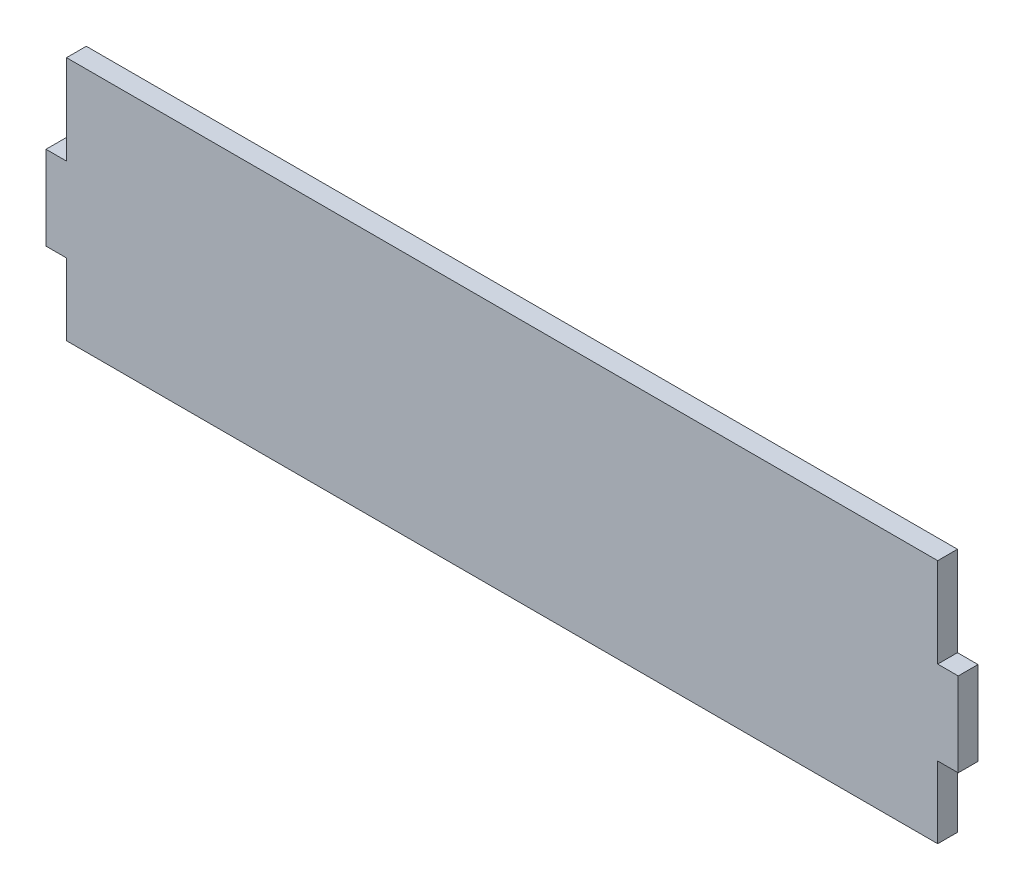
ISO-10303-21;
HEADER;
FILE_DESCRIPTION(('STEP AP214'),'2;1');
FILE_NAME('part.step','',(''),(''),'','','');
FILE_SCHEMA(('AUTOMOTIVE_DESIGN { 1 0 10303 214 1 1 1 1 }'));
ENDSEC;
DATA;
#1=APPLICATION_CONTEXT('core data for automotive mechanical design processes');
#2=APPLICATION_PROTOCOL_DEFINITION('international standard','automotive_design',2000,#1);
#3=PRODUCT_CONTEXT('',#1,'mechanical');
#4=PRODUCT('Part','Part','',(#3));
#5=PRODUCT_RELATED_PRODUCT_CATEGORY('part','',(#4));
#6=PRODUCT_DEFINITION_FORMATION('','',#4);
#7=PRODUCT_DEFINITION_CONTEXT('part definition',#1,'design');
#8=PRODUCT_DEFINITION('design','',#6,#7);
#9=PRODUCT_DEFINITION_SHAPE('','',#8);
#10=(LENGTH_UNIT() NAMED_UNIT(*) SI_UNIT(.MILLI.,.METRE.));
#11=(NAMED_UNIT(*) PLANE_ANGLE_UNIT() SI_UNIT($,.RADIAN.));
#12=(NAMED_UNIT(*) SI_UNIT($,.STERADIAN.) SOLID_ANGLE_UNIT());
#13=UNCERTAINTY_MEASURE_WITH_UNIT(LENGTH_MEASURE(1.E-05),#10,'distance_accuracy_value','');
#14=(GEOMETRIC_REPRESENTATION_CONTEXT(3) GLOBAL_UNCERTAINTY_ASSIGNED_CONTEXT((#13)) GLOBAL_UNIT_ASSIGNED_CONTEXT((#10,
#11,#12)) REPRESENTATION_CONTEXT('',''));
#15=CARTESIAN_POINT('',(0.,0.,0.));
#16=DIRECTION('',(0.,0.,1.));
#17=DIRECTION('',(1.,0.,0.));
#18=AXIS2_PLACEMENT_3D('',#15,#16,#17);
#19=CARTESIAN_POINT('',(0.,-19.7909035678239,2.6));
#20=DIRECTION('',(0.,-1.,0.));
#21=DIRECTION('',(1.,0.,0.));
#22=AXIS2_PLACEMENT_3D('',#19,#20,#21);
#23=PLANE('',#22);
#24=DIRECTION('',(-1.,0.,0.));
#25=VECTOR('',#24,1.);
#26=CARTESIAN_POINT('',(0.,-19.7909035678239,0.));
#27=LINE('',#26,#25);
#28=CARTESIAN_POINT('',(48.0499566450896,-19.7909035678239,0.));
#29=VERTEX_POINT('',#28);
#30=CARTESIAN_POINT('',(-66.5500433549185,-19.7909035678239,0.));
#31=VERTEX_POINT('',#30);
#32=EDGE_CURVE('E157',#29,#31,#27,.T.);
#33=ORIENTED_EDGE('',*,*,#32,.F.);
#34=DIRECTION('',(0.,0.,-1.));
#35=VECTOR('',#34,1.);
#36=CARTESIAN_POINT('',(48.0499566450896,-19.7909035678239,2.6));
#37=LINE('',#36,#35);
#38=CARTESIAN_POINT('',(48.0499566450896,-19.7909035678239,2.6));
#39=VERTEX_POINT('',#38);
#40=EDGE_CURVE('E11',#39,#29,#37,.T.);
#41=ORIENTED_EDGE('',*,*,#40,.F.);
#42=DIRECTION('',(-1.,0.,0.));
#43=VECTOR('',#42,1.);
#44=CARTESIAN_POINT('',(0.,-19.7909035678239,2.6));
#45=LINE('',#44,#43);
#46=CARTESIAN_POINT('',(-66.5500433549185,-19.7909035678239,2.6));
#47=VERTEX_POINT('',#46);
#48=EDGE_CURVE('E187',#39,#47,#45,.T.);
#49=ORIENTED_EDGE('',*,*,#48,.T.);
#50=DIRECTION('',(0.,0.,-1.));
#51=VECTOR('',#50,1.);
#52=CARTESIAN_POINT('',(-66.5500433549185,-19.7909035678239,2.6));
#53=LINE('',#52,#51);
#54=EDGE_CURVE('E55',#47,#31,#53,.T.);
#55=ORIENTED_EDGE('',*,*,#54,.T.);
#56=EDGE_LOOP('',(#33,#41,#49,#55));
#57=FACE_BOUND('',#56,.T.);
#58=ADVANCED_FACE('F39',(#57),#23,.T.);
#59=CARTESIAN_POINT('',(48.0499566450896,0.,2.6));
#60=DIRECTION('',(-1.,0.,0.));
#61=DIRECTION('',(0.,0.,1.));
#62=AXIS2_PLACEMENT_3D('',#59,#60,#61);
#63=PLANE('',#62);
#64=DIRECTION('',(0.,1.,0.));
#65=VECTOR('',#64,1.);
#66=CARTESIAN_POINT('',(48.0499566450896,0.,0.));
#67=LINE('',#66,#65);
#68=CARTESIAN_POINT('',(48.0499566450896,-10.3613832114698,0.));
#69=VERTEX_POINT('',#68);
#70=EDGE_CURVE('E159',#29,#69,#67,.T.);
#71=ORIENTED_EDGE('',*,*,#70,.T.);
#72=DIRECTION('',(0.,0.,-1.));
#73=VECTOR('',#72,1.);
#74=CARTESIAN_POINT('',(48.0499566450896,-10.3613832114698,2.6));
#75=LINE('',#74,#73);
#76=CARTESIAN_POINT('',(48.0499566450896,-10.3613832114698,2.6));
#77=VERTEX_POINT('',#76);
#78=EDGE_CURVE('E47',#77,#69,#75,.T.);
#79=ORIENTED_EDGE('',*,*,#78,.F.);
#80=DIRECTION('',(0.,1.,0.));
#81=VECTOR('',#80,1.);
#82=CARTESIAN_POINT('',(48.0499566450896,0.,2.6));
#83=LINE('',#82,#81);
#84=EDGE_CURVE('E225',#39,#77,#83,.T.);
#85=ORIENTED_EDGE('',*,*,#84,.F.);
#86=ORIENTED_EDGE('',*,*,#40,.T.);
#87=EDGE_LOOP('',(#71,#79,#85,#86));
#88=FACE_BOUND('',#87,.T.);
#89=ADVANCED_FACE('F213',(#88),#63,.F.);
#90=CARTESIAN_POINT('',(0.,-10.3613832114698,2.6));
#91=DIRECTION('',(0.,-1.,0.));
#92=DIRECTION('',(1.,0.,0.));
#93=AXIS2_PLACEMENT_3D('',#90,#91,#92);
#94=PLANE('',#93);
#95=DIRECTION('',(-1.,0.,0.));
#96=VECTOR('',#95,1.);
#97=CARTESIAN_POINT('',(0.,-10.3613832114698,0.));
#98=LINE('',#97,#96);
#99=CARTESIAN_POINT('',(50.7499566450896,-10.3613832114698,0.));
#100=VERTEX_POINT('',#99);
#101=EDGE_CURVE('E162',#100,#69,#98,.T.);
#102=ORIENTED_EDGE('',*,*,#101,.F.);
#103=DIRECTION('',(0.,0.,-1.));
#104=VECTOR('',#103,1.);
#105=CARTESIAN_POINT('',(50.7499566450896,-10.3613832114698,2.6));
#106=LINE('',#105,#104);
#107=CARTESIAN_POINT('',(50.7499566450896,-10.3613832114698,2.6));
#108=VERTEX_POINT('',#107);
#109=EDGE_CURVE('E203',#108,#100,#106,.T.);
#110=ORIENTED_EDGE('',*,*,#109,.F.);
#111=DIRECTION('',(-1.,0.,0.));
#112=VECTOR('',#111,1.);
#113=CARTESIAN_POINT('',(0.,-10.3613832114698,2.6));
#114=LINE('',#113,#112);
#115=EDGE_CURVE('E210',#108,#77,#114,.T.);
#116=ORIENTED_EDGE('',*,*,#115,.T.);
#117=ORIENTED_EDGE('',*,*,#78,.T.);
#118=EDGE_LOOP('',(#102,#110,#116,#117));
#119=FACE_BOUND('',#118,.T.);
#120=ADVANCED_FACE('F208',(#119),#94,.T.);
#121=CARTESIAN_POINT('',(50.7499566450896,0.,2.6));
#122=DIRECTION('',(1.,0.,0.));
#123=DIRECTION('',(0.,0.,-1.));
#124=AXIS2_PLACEMENT_3D('',#121,#122,#123);
#125=PLANE('',#124);
#126=DIRECTION('',(0.,-1.,0.));
#127=VECTOR('',#126,1.);
#128=CARTESIAN_POINT('',(50.7499566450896,0.,0.));
#129=LINE('',#128,#127);
#130=CARTESIAN_POINT('',(50.7499566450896,0.676831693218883,0.));
#131=VERTEX_POINT('',#130);
#132=EDGE_CURVE('E165',#131,#100,#129,.T.);
#133=ORIENTED_EDGE('',*,*,#132,.F.);
#134=DIRECTION('',(0.,0.,-1.));
#135=VECTOR('',#134,1.);
#136=CARTESIAN_POINT('',(50.7499566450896,0.676831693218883,2.6));
#137=LINE('',#136,#135);
#138=CARTESIAN_POINT('',(50.7499566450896,0.676831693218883,2.6));
#139=VERTEX_POINT('',#138);
#140=EDGE_CURVE('E201',#139,#131,#137,.T.);
#141=ORIENTED_EDGE('',*,*,#140,.F.);
#142=DIRECTION('',(0.,-1.,0.));
#143=VECTOR('',#142,1.);
#144=CARTESIAN_POINT('',(50.7499566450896,0.,2.6));
#145=LINE('',#144,#143);
#146=EDGE_CURVE('E224',#139,#108,#145,.T.);
#147=ORIENTED_EDGE('',*,*,#146,.T.);
#148=ORIENTED_EDGE('',*,*,#109,.T.);
#149=EDGE_LOOP('',(#133,#141,#147,#148));
#150=FACE_BOUND('',#149,.T.);
#151=ADVANCED_FACE('F220',(#150),#125,.T.);
#152=CARTESIAN_POINT('',(0.,0.676831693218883,2.6));
#153=DIRECTION('',(0.,-1.,0.));
#154=DIRECTION('',(0.,0.,-1.));
#155=AXIS2_PLACEMENT_3D('',#152,#153,#154);
#156=PLANE('',#155);
#157=DIRECTION('',(-1.,0.,0.));
#158=VECTOR('',#157,1.);
#159=CARTESIAN_POINT('',(0.,0.676831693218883,0.));
#160=LINE('',#159,#158);
#161=CARTESIAN_POINT('',(48.0499566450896,0.676831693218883,0.));
#162=VERTEX_POINT('',#161);
#163=EDGE_CURVE('E168',#131,#162,#160,.T.);
#164=ORIENTED_EDGE('',*,*,#163,.T.);
#165=DIRECTION('',(0.,0.,-1.));
#166=VECTOR('',#165,1.);
#167=CARTESIAN_POINT('',(48.0499566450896,0.676831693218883,2.6));
#168=LINE('',#167,#166);
#169=CARTESIAN_POINT('',(48.0499566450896,0.676831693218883,2.6));
#170=VERTEX_POINT('',#169);
#171=EDGE_CURVE('E198',#170,#162,#168,.T.);
#172=ORIENTED_EDGE('',*,*,#171,.F.);
#173=DIRECTION('',(-1.,0.,0.));
#174=VECTOR('',#173,1.);
#175=CARTESIAN_POINT('',(0.,0.676831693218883,2.6));
#176=LINE('',#175,#174);
#177=EDGE_CURVE('E227',#139,#170,#176,.T.);
#178=ORIENTED_EDGE('',*,*,#177,.F.);
#179=ORIENTED_EDGE('',*,*,#140,.T.);
#180=EDGE_LOOP('',(#164,#172,#178,#179));
#181=FACE_BOUND('',#180,.T.);
#182=ADVANCED_FACE('F264',(#181),#156,.F.);
#183=CARTESIAN_POINT('',(48.0499566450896,0.,2.6));
#184=DIRECTION('',(-1.,0.,0.));
#185=DIRECTION('',(0.,0.,1.));
#186=AXIS2_PLACEMENT_3D('',#183,#184,#185);
#187=PLANE('',#186);
#188=DIRECTION('',(0.,1.,0.));
#189=VECTOR('',#188,1.);
#190=CARTESIAN_POINT('',(48.0499566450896,0.,0.));
#191=LINE('',#190,#189);
#192=CARTESIAN_POINT('',(48.0499566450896,12.4611816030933,0.));
#193=VERTEX_POINT('',#192);
#194=EDGE_CURVE('E170',#162,#193,#191,.T.);
#195=ORIENTED_EDGE('',*,*,#194,.T.);
#196=DIRECTION('',(0.,0.,-1.));
#197=VECTOR('',#196,1.);
#198=CARTESIAN_POINT('',(48.0499566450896,12.4611816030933,2.6));
#199=LINE('',#198,#197);
#200=CARTESIAN_POINT('',(48.0499566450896,12.4611816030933,2.6));
#201=VERTEX_POINT('',#200);
#202=EDGE_CURVE('E195',#201,#193,#199,.T.);
#203=ORIENTED_EDGE('',*,*,#202,.F.);
#204=DIRECTION('',(0.,1.,0.));
#205=VECTOR('',#204,1.);
#206=CARTESIAN_POINT('',(48.0499566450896,0.,2.6));
#207=LINE('',#206,#205);
#208=EDGE_CURVE('E233',#170,#201,#207,.T.);
#209=ORIENTED_EDGE('',*,*,#208,.F.);
#210=ORIENTED_EDGE('',*,*,#171,.T.);
#211=EDGE_LOOP('',(#195,#203,#209,#210));
#212=FACE_BOUND('',#211,.T.);
#213=ADVANCED_FACE('F267',(#212),#187,.F.);
#214=CARTESIAN_POINT('',(0.,12.4611816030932,2.6));
#215=DIRECTION('',(0.,-1.,0.));
#216=DIRECTION('',(1.,0.,0.));
#217=AXIS2_PLACEMENT_3D('',#214,#215,#216);
#218=PLANE('',#217);
#219=DIRECTION('',(-1.,0.,0.));
#220=VECTOR('',#219,1.);
#221=CARTESIAN_POINT('',(0.,12.4611816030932,0.));
#222=LINE('',#221,#220);
#223=CARTESIAN_POINT('',(-66.5500433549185,12.4611816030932,0.));
#224=VERTEX_POINT('',#223);
#225=EDGE_CURVE('E172',#193,#224,#222,.T.);
#226=ORIENTED_EDGE('',*,*,#225,.T.);
#227=DIRECTION('',(0.,0.,-1.));
#228=VECTOR('',#227,1.);
#229=CARTESIAN_POINT('',(-66.5500433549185,12.4611816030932,2.6));
#230=LINE('',#229,#228);
#231=CARTESIAN_POINT('',(-66.5500433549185,12.4611816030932,2.6));
#232=VERTEX_POINT('',#231);
#233=EDGE_CURVE('E193',#232,#224,#230,.T.);
#234=ORIENTED_EDGE('',*,*,#233,.F.);
#235=DIRECTION('',(-1.,0.,0.));
#236=VECTOR('',#235,1.);
#237=CARTESIAN_POINT('',(0.,12.4611816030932,2.6));
#238=LINE('',#237,#236);
#239=EDGE_CURVE('E235',#201,#232,#238,.T.);
#240=ORIENTED_EDGE('',*,*,#239,.F.);
#241=ORIENTED_EDGE('',*,*,#202,.T.);
#242=EDGE_LOOP('',(#226,#234,#240,#241));
#243=FACE_BOUND('',#242,.T.);
#244=ADVANCED_FACE('F271',(#243),#218,.F.);
#245=CARTESIAN_POINT('',(-66.5500433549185,0.,2.6));
#246=DIRECTION('',(-1.,0.,0.));
#247=DIRECTION('',(0.,0.,1.));
#248=AXIS2_PLACEMENT_3D('',#245,#246,#247);
#249=PLANE('',#248);
#250=DIRECTION('',(0.,1.,0.));
#251=VECTOR('',#250,1.);
#252=CARTESIAN_POINT('',(-66.5500433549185,0.,0.));
#253=LINE('',#252,#251);
#254=CARTESIAN_POINT('',(-66.5500433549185,0.676831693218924,0.));
#255=VERTEX_POINT('',#254);
#256=EDGE_CURVE('E175',#255,#224,#253,.T.);
#257=ORIENTED_EDGE('',*,*,#256,.F.);
#258=DIRECTION('',(0.,0.,-1.));
#259=VECTOR('',#258,1.);
#260=CARTESIAN_POINT('',(-66.5500433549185,0.676831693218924,2.6));
#261=LINE('',#260,#259);
#262=CARTESIAN_POINT('',(-66.5500433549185,0.676831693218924,2.6));
#263=VERTEX_POINT('',#262);
#264=EDGE_CURVE('E191',#263,#255,#261,.T.);
#265=ORIENTED_EDGE('',*,*,#264,.F.);
#266=DIRECTION('',(0.,1.,0.));
#267=VECTOR('',#266,1.);
#268=CARTESIAN_POINT('',(-66.5500433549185,0.,2.6));
#269=LINE('',#268,#267);
#270=EDGE_CURVE('E237',#263,#232,#269,.T.);
#271=ORIENTED_EDGE('',*,*,#270,.T.);
#272=ORIENTED_EDGE('',*,*,#233,.T.);
#273=EDGE_LOOP('',(#257,#265,#271,#272));
#274=FACE_BOUND('',#273,.T.);
#275=ADVANCED_FACE('F275',(#274),#249,.T.);
#276=CARTESIAN_POINT('',(0.,0.676831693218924,2.6));
#277=DIRECTION('',(0.,1.,0.));
#278=DIRECTION('',(0.,0.,1.));
#279=AXIS2_PLACEMENT_3D('',#276,#277,#278);
#280=PLANE('',#279);
#281=DIRECTION('',(1.,0.,0.));
#282=VECTOR('',#281,1.);
#283=CARTESIAN_POINT('',(0.,0.676831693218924,0.));
#284=LINE('',#283,#282);
#285=CARTESIAN_POINT('',(-69.2500433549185,0.676831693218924,0.));
#286=VERTEX_POINT('',#285);
#287=EDGE_CURVE('E178',#286,#255,#284,.T.);
#288=ORIENTED_EDGE('',*,*,#287,.F.);
#289=DIRECTION('',(0.,0.,-1.));
#290=VECTOR('',#289,1.);
#291=CARTESIAN_POINT('',(-69.2500433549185,0.676831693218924,2.6));
#292=LINE('',#291,#290);
#293=CARTESIAN_POINT('',(-69.2500433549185,0.676831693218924,2.6));
#294=VERTEX_POINT('',#293);
#295=EDGE_CURVE('E138',#294,#286,#292,.T.);
#296=ORIENTED_EDGE('',*,*,#295,.F.);
#297=DIRECTION('',(1.,0.,0.));
#298=VECTOR('',#297,1.);
#299=CARTESIAN_POINT('',(0.,0.676831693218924,2.6));
#300=LINE('',#299,#298);
#301=EDGE_CURVE('E149',#294,#263,#300,.T.);
#302=ORIENTED_EDGE('',*,*,#301,.T.);
#303=ORIENTED_EDGE('',*,*,#264,.T.);
#304=EDGE_LOOP('',(#288,#296,#302,#303));
#305=FACE_BOUND('',#304,.T.);
#306=ADVANCED_FACE('F241',(#305),#280,.T.);
#307=CARTESIAN_POINT('',(-69.2500433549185,0.,2.6));
#308=DIRECTION('',(-1.,0.,0.));
#309=DIRECTION('',(0.,0.,1.));
#310=AXIS2_PLACEMENT_3D('',#307,#308,#309);
#311=PLANE('',#310);
#312=DIRECTION('',(0.,1.,0.));
#313=VECTOR('',#312,1.);
#314=CARTESIAN_POINT('',(-69.2500433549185,0.,0.));
#315=LINE('',#314,#313);
#316=CARTESIAN_POINT('',(-69.2500433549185,-10.3613832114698,0.));
#317=VERTEX_POINT('',#316);
#318=EDGE_CURVE('E134',#317,#286,#315,.T.);
#319=ORIENTED_EDGE('',*,*,#318,.F.);
#320=DIRECTION('',(0.,0.,-1.));
#321=VECTOR('',#320,1.);
#322=CARTESIAN_POINT('',(-69.2500433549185,-10.3613832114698,2.6));
#323=LINE('',#322,#321);
#324=CARTESIAN_POINT('',(-69.2500433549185,-10.3613832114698,2.6));
#325=VERTEX_POINT('',#324);
#326=EDGE_CURVE('E129',#325,#317,#323,.T.);
#327=ORIENTED_EDGE('',*,*,#326,.F.);
#328=DIRECTION('',(0.,1.,0.));
#329=VECTOR('',#328,1.);
#330=CARTESIAN_POINT('',(-69.2500433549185,0.,2.6));
#331=LINE('',#330,#329);
#332=EDGE_CURVE('E132',#325,#294,#331,.T.);
#333=ORIENTED_EDGE('',*,*,#332,.T.);
#334=ORIENTED_EDGE('',*,*,#295,.T.);
#335=EDGE_LOOP('',(#319,#327,#333,#334));
#336=FACE_BOUND('',#335,.T.);
#337=ADVANCED_FACE('F131',(#336),#311,.T.);
#338=CARTESIAN_POINT('',(0.,-10.3613832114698,2.6));
#339=DIRECTION('',(0.,-1.,0.));
#340=DIRECTION('',(1.,0.,0.));
#341=AXIS2_PLACEMENT_3D('',#338,#339,#340);
#342=PLANE('',#341);
#343=DIRECTION('',(-1.,0.,0.));
#344=VECTOR('',#343,1.);
#345=CARTESIAN_POINT('',(0.,-10.3613832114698,0.));
#346=LINE('',#345,#344);
#347=CARTESIAN_POINT('',(-66.5500433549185,-10.3613832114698,0.));
#348=VERTEX_POINT('',#347);
#349=EDGE_CURVE('E182',#348,#317,#346,.T.);
#350=ORIENTED_EDGE('',*,*,#349,.F.);
#351=DIRECTION('',(0.,0.,-1.));
#352=VECTOR('',#351,1.);
#353=CARTESIAN_POINT('',(-66.5500433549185,-10.3613832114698,2.6));
#354=LINE('',#353,#352);
#355=CARTESIAN_POINT('',(-66.5500433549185,-10.3613832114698,2.6));
#356=VERTEX_POINT('',#355);
#357=EDGE_CURVE('E92',#356,#348,#354,.T.);
#358=ORIENTED_EDGE('',*,*,#357,.F.);
#359=DIRECTION('',(-1.,0.,0.));
#360=VECTOR('',#359,1.);
#361=CARTESIAN_POINT('',(0.,-10.3613832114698,2.6));
#362=LINE('',#361,#360);
#363=EDGE_CURVE('E146',#356,#325,#362,.T.);
#364=ORIENTED_EDGE('',*,*,#363,.T.);
#365=ORIENTED_EDGE('',*,*,#326,.T.);
#366=EDGE_LOOP('',(#350,#358,#364,#365));
#367=FACE_BOUND('',#366,.T.);
#368=ADVANCED_FACE('F151',(#367),#342,.T.);
#369=CARTESIAN_POINT('',(-66.5500433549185,0.,2.6));
#370=DIRECTION('',(-1.,0.,0.));
#371=DIRECTION('',(0.,0.,1.));
#372=AXIS2_PLACEMENT_3D('',#369,#370,#371);
#373=PLANE('',#372);
#374=DIRECTION('',(0.,1.,0.));
#375=VECTOR('',#374,1.);
#376=CARTESIAN_POINT('',(-66.5500433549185,0.,0.));
#377=LINE('',#376,#375);
#378=EDGE_CURVE('E184',#31,#348,#377,.T.);
#379=ORIENTED_EDGE('',*,*,#378,.F.);
#380=ORIENTED_EDGE('',*,*,#54,.F.);
#381=DIRECTION('',(0.,1.,0.));
#382=VECTOR('',#381,1.);
#383=CARTESIAN_POINT('',(-66.5500433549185,0.,2.6));
#384=LINE('',#383,#382);
#385=EDGE_CURVE('E152',#47,#356,#384,.T.);
#386=ORIENTED_EDGE('',*,*,#385,.T.);
#387=ORIENTED_EDGE('',*,*,#357,.T.);
#388=EDGE_LOOP('',(#379,#380,#386,#387));
#389=FACE_BOUND('',#388,.T.);
#390=ADVANCED_FACE('F243',(#389),#373,.T.);
#391=CARTESIAN_POINT('',(0.,0.,2.6));
#392=DIRECTION('',(0.,0.,1.));
#393=DIRECTION('',(1.,0.,0.));
#394=AXIS2_PLACEMENT_3D('',#391,#392,#393);
#395=PLANE('',#394);
#396=ORIENTED_EDGE('',*,*,#48,.F.);
#397=ORIENTED_EDGE('',*,*,#84,.T.);
#398=ORIENTED_EDGE('',*,*,#115,.F.);
#399=ORIENTED_EDGE('',*,*,#146,.F.);
#400=ORIENTED_EDGE('',*,*,#177,.T.);
#401=ORIENTED_EDGE('',*,*,#208,.T.);
#402=ORIENTED_EDGE('',*,*,#239,.T.);
#403=ORIENTED_EDGE('',*,*,#270,.F.);
#404=ORIENTED_EDGE('',*,*,#301,.F.);
#405=ORIENTED_EDGE('',*,*,#332,.F.);
#406=ORIENTED_EDGE('',*,*,#363,.F.);
#407=ORIENTED_EDGE('',*,*,#385,.F.);
#408=EDGE_LOOP('',(#396,#397,#398,#399,#400,#401,#402,#403,#404,#405,#406,#407));
#409=FACE_BOUND('',#408,.T.);
#410=ADVANCED_FACE('F144',(#409),#395,.T.);
#411=CARTESIAN_POINT('',(0.,0.,0.));
#412=DIRECTION('',(0.,0.,1.));
#413=DIRECTION('',(1.,0.,0.));
#414=AXIS2_PLACEMENT_3D('',#411,#412,#413);
#415=PLANE('',#414);
#416=ORIENTED_EDGE('',*,*,#32,.T.);
#417=ORIENTED_EDGE('',*,*,#378,.T.);
#418=ORIENTED_EDGE('',*,*,#349,.T.);
#419=ORIENTED_EDGE('',*,*,#318,.T.);
#420=ORIENTED_EDGE('',*,*,#287,.T.);
#421=ORIENTED_EDGE('',*,*,#256,.T.);
#422=ORIENTED_EDGE('',*,*,#225,.F.);
#423=ORIENTED_EDGE('',*,*,#194,.F.);
#424=ORIENTED_EDGE('',*,*,#163,.F.);
#425=ORIENTED_EDGE('',*,*,#132,.T.);
#426=ORIENTED_EDGE('',*,*,#101,.T.);
#427=ORIENTED_EDGE('',*,*,#70,.F.);
#428=EDGE_LOOP('',(#416,#417,#418,#419,#420,#421,#422,#423,#424,#425,#426,#427));
#429=FACE_BOUND('',#428,.T.);
#430=ADVANCED_FACE('F215',(#429),#415,.F.);
#431=CLOSED_SHELL('',(#58,#89,#120,#151,#182,#213,#244,#275,#306,#337,#368,#390,#410,#430));
#432=MANIFOLD_SOLID_BREP('B2',#431);
#433=ADVANCED_BREP_SHAPE_REPRESENTATION('',(#18,#432),#14);
#434=SHAPE_DEFINITION_REPRESENTATION(#9,#433);
ENDSEC;
END-ISO-10303-21;
